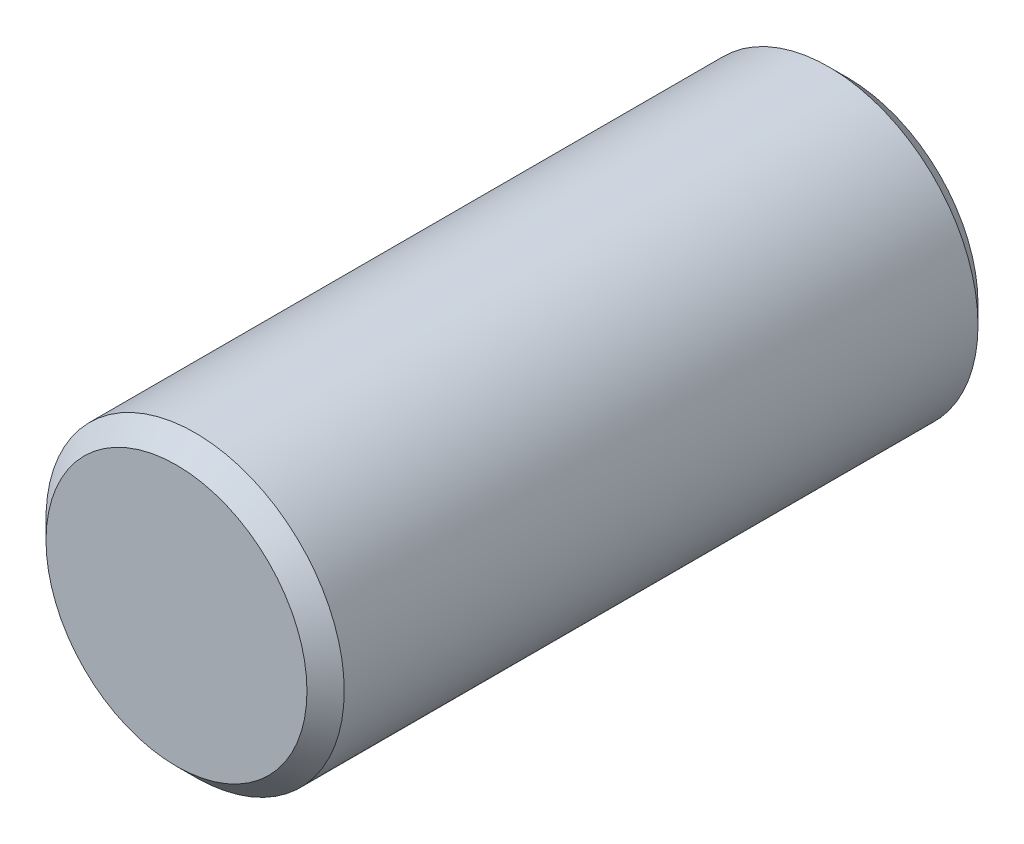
from build123d import *

# Parameters (mm, degrees)
ESQUISSE1_R          = 4
BASE_EXTRUSION_DEPTH = 9
CHANFREIN1_SIZE      = 0.5


with BuildPart() as part:
    # Esquisse1 → Base-Extrusion (new, symmetric)
    with BuildSketch(Plane.XY):
        with Locations((0, 32)):
            Circle(ESQUISSE1_R)
    extrude(amount=BASE_EXTRUSION_DEPTH, both=True)

    # Chanfrein1
    chanfrein1_edges = [part.edges().sort_by_distance(p)[0] for p in [
        (-4, 32, -9),
        (-4, 32, 9),
    ]]
    chamfer(chanfrein1_edges, length=CHANFREIN1_SIZE)


solid = part.part
